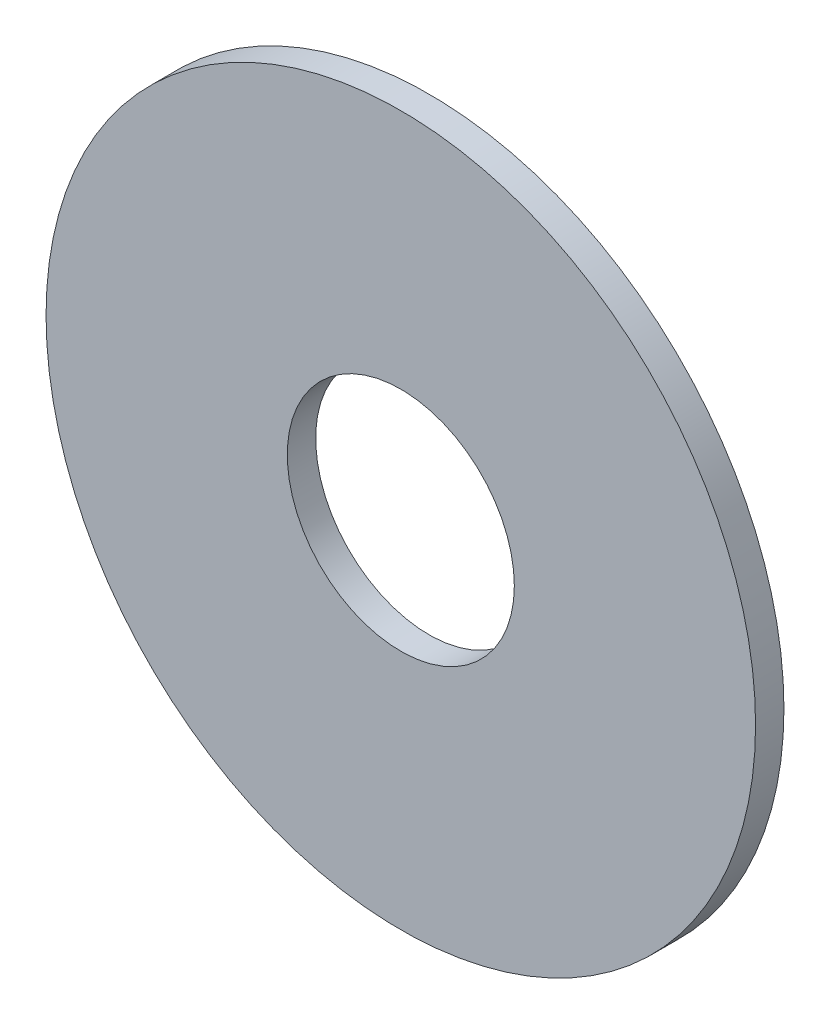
from build123d import *

# Parameters (mm, degrees)
SKETCH1_R           = 12.5
BOSS_EXTRUDE1_DEPTH = 1
SKETCH2_R           = 4
CUT_EXTRUDE1_DEPTH  = 1


with BuildPart() as part:
    # Sketch1 → Boss-Extrude1 (new body)
    with BuildSketch(Plane.XY):
        Circle(SKETCH1_R)
    extrude(amount=-BOSS_EXTRUDE1_DEPTH)

    # Sketch2 → Cut-Extrude1 (cut)
    with BuildSketch(Plane.XY):
        Circle(SKETCH2_R)
    extrude(amount=-CUT_EXTRUDE1_DEPTH, mode=Mode.SUBTRACT)


solid = part.part
